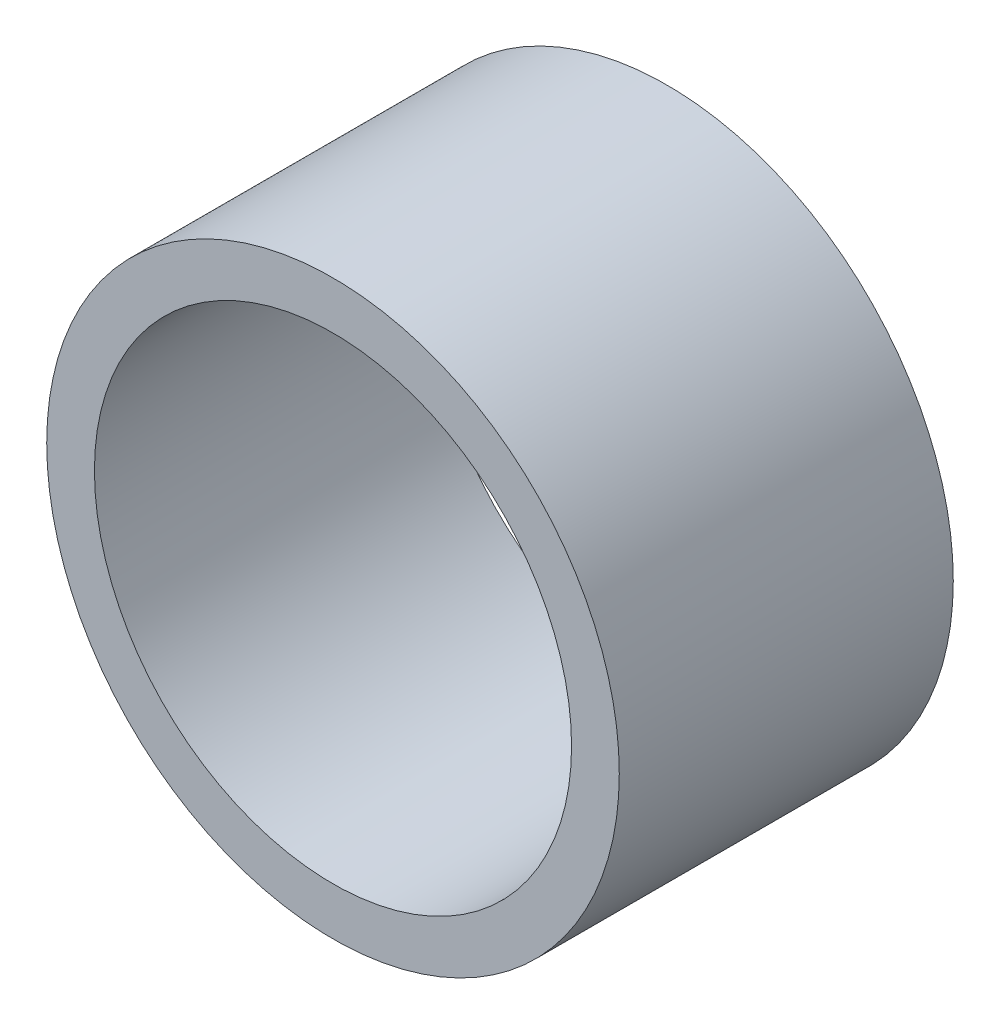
from build123d import *

# Parameters (mm, degrees)
ESQUISSE1_R      = 12
ESQUISSE1_R_2    = 10
EXTRUSION1_DEPTH = 14


with BuildPart() as part:
    # Esquisse1 → Extrusion1 (new body)
    with BuildSketch(Plane.XY):
        Circle(ESQUISSE1_R)
        Circle(ESQUISSE1_R_2, mode=Mode.SUBTRACT)
    extrude(amount=EXTRUSION1_DEPTH)


solid = part.part
